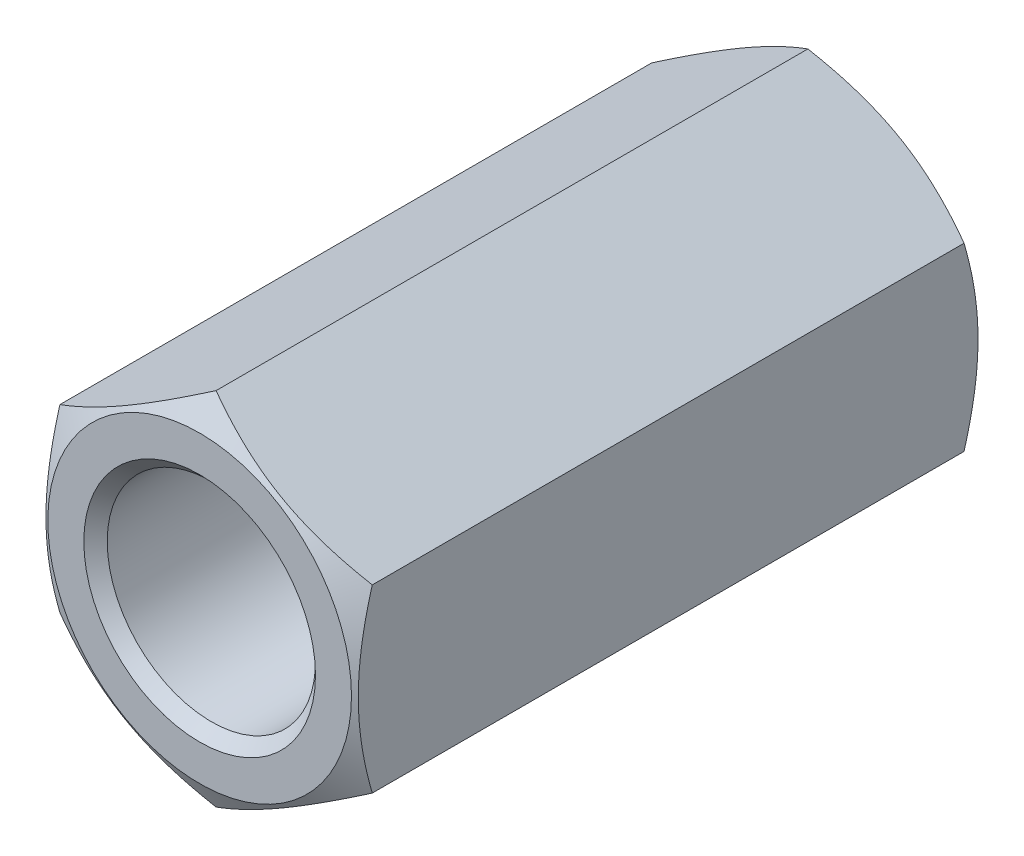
ISO-10303-21;
HEADER;
FILE_DESCRIPTION(('STEP AP214'),'2;1');
FILE_NAME('part.step','',(''),(''),'','','');
FILE_SCHEMA(('AUTOMOTIVE_DESIGN { 1 0 10303 214 1 1 1 1 }'));
ENDSEC;
DATA;
#1=APPLICATION_CONTEXT('core data for automotive mechanical design processes');
#2=APPLICATION_PROTOCOL_DEFINITION('international standard','automotive_design',2000,#1);
#3=PRODUCT_CONTEXT('',#1,'mechanical');
#4=PRODUCT('Part','Part','',(#3));
#5=PRODUCT_RELATED_PRODUCT_CATEGORY('part','',(#4));
#6=PRODUCT_DEFINITION_FORMATION('','',#4);
#7=PRODUCT_DEFINITION_CONTEXT('part definition',#1,'design');
#8=PRODUCT_DEFINITION('design','',#6,#7);
#9=PRODUCT_DEFINITION_SHAPE('','',#8);
#10=(LENGTH_UNIT() NAMED_UNIT(*) SI_UNIT(.MILLI.,.METRE.));
#11=(NAMED_UNIT(*) PLANE_ANGLE_UNIT() SI_UNIT($,.RADIAN.));
#12=(NAMED_UNIT(*) SI_UNIT($,.STERADIAN.) SOLID_ANGLE_UNIT());
#13=UNCERTAINTY_MEASURE_WITH_UNIT(LENGTH_MEASURE(1.E-05),#10,'distance_accuracy_value','');
#14=(GEOMETRIC_REPRESENTATION_CONTEXT(3) GLOBAL_UNCERTAINTY_ASSIGNED_CONTEXT((#13)) GLOBAL_UNIT_ASSIGNED_CONTEXT((#10,
#11,#12)) REPRESENTATION_CONTEXT('',''));
#15=CARTESIAN_POINT('',(0.,0.,0.));
#16=DIRECTION('',(0.,0.,1.));
#17=DIRECTION('',(1.,0.,0.));
#18=AXIS2_PLACEMENT_3D('',#15,#16,#17);
#19=CARTESIAN_POINT('',(0.,-20.7846096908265,72.));
#20=DIRECTION('',(-0.5,-0.86602540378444,0.));
#21=DIRECTION('',(0.86602540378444,-0.5,0.));
#22=AXIS2_PLACEMENT_3D('',#19,#20,#21);
#23=PLANE('',#22);
#24=DIRECTION('',(0.,0.,-1.));
#25=VECTOR('',#24,1.);
#26=CARTESIAN_POINT('',(-18.,-10.3923048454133,72.));
#27=LINE('',#26,#25);
#28=CARTESIAN_POINT('',(-18.,-10.3923048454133,70.1036297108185));
#29=VERTEX_POINT('',#28);
#30=CARTESIAN_POINT('',(-18.,-10.3923048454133,1.89637028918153));
#31=VERTEX_POINT('',#30);
#32=EDGE_CURVE('E87',#29,#31,#27,.T.);
#33=ORIENTED_EDGE('',*,*,#32,.T.);
#34=CARTESIAN_POINT('',(-18.0002,-10.3921893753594,1.89643695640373));
#35=CARTESIAN_POINT('',(-17.6045674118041,-10.6206079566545,1.76456850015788));
#36=CARTESIAN_POINT('',(-17.2073916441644,-10.8499174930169,1.63868402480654));
#37=CARTESIAN_POINT('',(-16.4098552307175,-11.310375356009,1.40054637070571));
#38=CARTESIAN_POINT('',(-16.0094935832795,-11.5415242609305,1.28829767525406));
#39=CARTESIAN_POINT('',(-15.2048116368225,-12.0061075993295,1.0789404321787));
#40=CARTESIAN_POINT('',(-14.8004842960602,-12.2395460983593,0.981867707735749));
#41=CARTESIAN_POINT('',(-13.9890201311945,-12.7080451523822,0.804946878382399));
#42=CARTESIAN_POINT('',(-13.5818834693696,-12.9431056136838,0.725097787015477));
#43=CARTESIAN_POINT('',(-12.7752328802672,-13.4088255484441,0.586020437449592));
#44=CARTESIAN_POINT('',(-12.3757788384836,-13.6394504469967,0.526331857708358));
#45=CARTESIAN_POINT('',(-11.5750403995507,-14.1017570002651,0.426247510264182));
#46=CARTESIAN_POINT('',(-11.1737559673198,-14.3334386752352,0.385852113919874));
#47=CARTESIAN_POINT('',(-10.3705130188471,-14.7971912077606,0.32537409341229));
#48=CARTESIAN_POINT('',(-9.96855587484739,-15.0292612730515,0.305267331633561));
#49=CARTESIAN_POINT('',(-9.16427056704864,-15.4936156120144,0.285798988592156));
#50=CARTESIAN_POINT('',(-8.76194241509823,-15.7258998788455,0.286436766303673));
#51=CARTESIAN_POINT('',(-8.0097806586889,-16.1601606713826,0.30700871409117));
#52=CARTESIAN_POINT('',(-7.65989346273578,-16.3621681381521,0.324434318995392));
#53=CARTESIAN_POINT('',(-6.96095368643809,-16.765701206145,0.374644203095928));
#54=CARTESIAN_POINT('',(-6.61190109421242,-16.9672268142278,0.407428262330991));
#55=CARTESIAN_POINT('',(-5.91476277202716,-17.3697198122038,0.487786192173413));
#56=CARTESIAN_POINT('',(-5.56667820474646,-17.5706865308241,0.535373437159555));
#57=CARTESIAN_POINT('',(-4.87216610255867,-17.9716632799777,0.644498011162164));
#58=CARTESIAN_POINT('',(-4.52573856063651,-18.1716733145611,0.706035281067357));
#59=CARTESIAN_POINT('',(-3.47411308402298,-18.7788295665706,0.913137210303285));
#60=CARTESIAN_POINT('',(-2.771960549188,-19.1842175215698,1.07935260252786));
#61=CARTESIAN_POINT('',(-1.37812528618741,-19.9889486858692,1.45659330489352));
#62=CARTESIAN_POINT('',(-0.68642471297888,-20.3883021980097,1.66753002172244));
#63=CARTESIAN_POINT('',(0.000199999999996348,-20.7847251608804,1.89643695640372));
#64=B_SPLINE_CURVE_WITH_KNOTS('',3,(#34,#35,#36,#37,#38,#39,#40,#41,#42,#43,#44,#45,#46,#47,#48,
#49,#50,#51,#52,#53,#54,#55,#56,#57,#58,#59,#60,#61,#62,#63),.UNSPECIFIED.,.F.,.F.,(4,2,2,2,2,2,
2,2,2,2,2,2,2,2,4),(0.,1.42650335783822,2.85347447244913,4.28376471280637,5.71397301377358,
7.10888071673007,8.5038152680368,9.89708828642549,11.2903182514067,12.5031974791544,
13.7160593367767,14.9300201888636,16.1439758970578,18.6253607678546,21.1018751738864),.UNSPECIFIED.);
#65=CARTESIAN_POINT('',(0.,-20.7846096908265,1.89637028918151));
#66=VERTEX_POINT('',#65);
#67=EDGE_CURVE('E29',#31,#66,#64,.T.);
#68=ORIENTED_EDGE('',*,*,#67,.T.);
#69=DIRECTION('',(0.,0.,-1.));
#70=VECTOR('',#69,1.);
#71=CARTESIAN_POINT('',(0.,-20.7846096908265,72.));
#72=LINE('',#71,#70);
#73=CARTESIAN_POINT('',(0.,-20.7846096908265,70.1036297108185));
#74=VERTEX_POINT('',#73);
#75=EDGE_CURVE('E100',#74,#66,#72,.T.);
#76=ORIENTED_EDGE('',*,*,#75,.F.);
#77=CARTESIAN_POINT('',(0.000199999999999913,-20.7847251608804,70.1035630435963));
#78=CARTESIAN_POINT('',(-0.395432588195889,-20.5563065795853,70.2354314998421));
#79=CARTESIAN_POINT('',(-0.792608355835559,-20.3269970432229,70.3613159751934));
#80=CARTESIAN_POINT('',(-1.59014476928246,-19.8665391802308,70.5994536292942));
#81=CARTESIAN_POINT('',(-1.99050641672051,-19.6353902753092,70.7117023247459));
#82=CARTESIAN_POINT('',(-2.79518836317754,-19.1708069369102,70.9210595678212));
#83=CARTESIAN_POINT('',(-3.19951570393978,-18.9373684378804,71.0181322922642));
#84=CARTESIAN_POINT('',(-4.01097986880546,-18.4688693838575,71.1950531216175));
#85=CARTESIAN_POINT('',(-4.41811653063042,-18.2338089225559,71.2749022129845));
#86=CARTESIAN_POINT('',(-5.22476711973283,-17.7680889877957,71.4139795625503));
#87=CARTESIAN_POINT('',(-5.62422116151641,-17.537464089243,71.4736681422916));
#88=CARTESIAN_POINT('',(-6.42495960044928,-17.0751575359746,71.5737524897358));
#89=CARTESIAN_POINT('',(-6.82624403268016,-16.8434758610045,71.6141478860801));
#90=CARTESIAN_POINT('',(-7.62948698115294,-16.3797233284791,71.6746259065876));
#91=CARTESIAN_POINT('',(-8.03144412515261,-16.1476532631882,71.6947326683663));
#92=CARTESIAN_POINT('',(-8.83572943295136,-15.6832989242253,71.7142010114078));
#93=CARTESIAN_POINT('',(-9.23805758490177,-15.4510146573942,71.7135632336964));
#94=CARTESIAN_POINT('',(-9.99021934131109,-15.0167538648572,71.6929912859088));
#95=CARTESIAN_POINT('',(-10.3401065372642,-14.8147463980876,71.6755656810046));
#96=CARTESIAN_POINT('',(-11.0390463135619,-14.4112133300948,71.625355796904));
#97=CARTESIAN_POINT('',(-11.3880989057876,-14.209687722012,71.5925717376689));
#98=CARTESIAN_POINT('',(-12.0852372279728,-13.8071947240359,71.5122138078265));
#99=CARTESIAN_POINT('',(-12.4333217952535,-13.6062280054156,71.4646265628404));
#100=CARTESIAN_POINT('',(-13.1278338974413,-13.2052512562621,71.3555019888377));
#101=CARTESIAN_POINT('',(-13.4742614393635,-13.0052412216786,71.2939647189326));
#102=CARTESIAN_POINT('',(-14.525886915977,-12.3980849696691,71.0868627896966));
#103=CARTESIAN_POINT('',(-15.228039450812,-11.99269701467,70.920647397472));
#104=CARTESIAN_POINT('',(-16.6218747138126,-11.1879658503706,70.5434066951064));
#105=CARTESIAN_POINT('',(-17.3135752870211,-10.78861233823,70.3324699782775));
#106=CARTESIAN_POINT('',(-18.0002,-10.3921893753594,70.1035630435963));
#107=B_SPLINE_CURVE_WITH_KNOTS('',3,(#77,#78,#79,#80,#81,#82,#83,#84,#85,#86,#87,#88,#89,#90,
#91,#92,#93,#94,#95,#96,#97,#98,#99,#100,#101,#102,#103,#104,#105,#106),.UNSPECIFIED.,.F.,.F.,
(4,2,2,2,2,2,2,2,2,2,2,2,2,2,4),(0.,1.4265033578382,2.85347447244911,4.28376471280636,
5.71397301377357,7.10888071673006,8.50381526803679,9.89708828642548,11.2903182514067,
12.5031974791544,13.7160593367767,14.9300201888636,16.1439758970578,18.6253607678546,
21.1018751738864),.UNSPECIFIED.);
#108=EDGE_CURVE('E91',#74,#29,#107,.T.);
#109=ORIENTED_EDGE('',*,*,#108,.T.);
#110=EDGE_LOOP('',(#33,#68,#76,#109));
#111=FACE_BOUND('',#110,.T.);
#112=ADVANCED_FACE('F14',(#111),#23,.T.);
#113=CARTESIAN_POINT('',(0.,-20.7846096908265,72.));
#114=DIRECTION('',(-0.5,0.86602540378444,0.));
#115=DIRECTION('',(-0.86602540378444,-0.5,0.));
#116=AXIS2_PLACEMENT_3D('',#113,#114,#115);
#117=PLANE('',#116);
#118=CARTESIAN_POINT('',(18.0002,-10.3921893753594,1.89643695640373));
#119=CARTESIAN_POINT('',(17.6045674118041,-10.6206079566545,1.76456850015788));
#120=CARTESIAN_POINT('',(17.2073916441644,-10.8499174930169,1.63868402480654));
#121=CARTESIAN_POINT('',(16.4098552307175,-11.310375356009,1.40054637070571));
#122=CARTESIAN_POINT('',(16.0094935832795,-11.5415242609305,1.28829767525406));
#123=CARTESIAN_POINT('',(15.2048116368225,-12.0061075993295,1.0789404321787));
#124=CARTESIAN_POINT('',(14.8004842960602,-12.2395460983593,0.981867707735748));
#125=CARTESIAN_POINT('',(13.9890201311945,-12.7080451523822,0.804946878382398));
#126=CARTESIAN_POINT('',(13.5818834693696,-12.9431056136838,0.725097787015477));
#127=CARTESIAN_POINT('',(12.7752328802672,-13.4088255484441,0.586020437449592));
#128=CARTESIAN_POINT('',(12.3757788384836,-13.6394504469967,0.526331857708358));
#129=CARTESIAN_POINT('',(11.5750403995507,-14.1017570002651,0.426247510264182));
#130=CARTESIAN_POINT('',(11.1737559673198,-14.3334386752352,0.385852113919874));
#131=CARTESIAN_POINT('',(10.3705130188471,-14.7971912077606,0.32537409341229));
#132=CARTESIAN_POINT('',(9.96855587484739,-15.0292612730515,0.305267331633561));
#133=CARTESIAN_POINT('',(9.16427056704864,-15.4936156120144,0.285798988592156));
#134=CARTESIAN_POINT('',(8.76194241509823,-15.7258998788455,0.286436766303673));
#135=CARTESIAN_POINT('',(8.0097806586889,-16.1601606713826,0.30700871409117));
#136=CARTESIAN_POINT('',(7.65989346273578,-16.3621681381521,0.324434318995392));
#137=CARTESIAN_POINT('',(6.96095368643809,-16.765701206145,0.374644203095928));
#138=CARTESIAN_POINT('',(6.61190109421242,-16.9672268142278,0.407428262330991));
#139=CARTESIAN_POINT('',(5.91476277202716,-17.3697198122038,0.487786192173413));
#140=CARTESIAN_POINT('',(5.56667820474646,-17.5706865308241,0.535373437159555));
#141=CARTESIAN_POINT('',(4.87216610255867,-17.9716632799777,0.644498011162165));
#142=CARTESIAN_POINT('',(4.52573856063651,-18.1716733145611,0.706035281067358));
#143=CARTESIAN_POINT('',(3.47411308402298,-18.7788295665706,0.913137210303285));
#144=CARTESIAN_POINT('',(2.771960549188,-19.1842175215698,1.07935260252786));
#145=CARTESIAN_POINT('',(1.37812528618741,-19.9889486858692,1.45659330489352));
#146=CARTESIAN_POINT('',(0.68642471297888,-20.3883021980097,1.66753002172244));
#147=CARTESIAN_POINT('',(-0.00019999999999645,-20.7847251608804,1.89643695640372));
#148=B_SPLINE_CURVE_WITH_KNOTS('',3,(#118,#119,#120,#121,#122,#123,#124,#125,#126,#127,#128,
#129,#130,#131,#132,#133,#134,#135,#136,#137,#138,#139,#140,#141,#142,#143,#144,#145,#146,#147),
.UNSPECIFIED.,.F.,.F.,(4,2,2,2,2,2,2,2,2,2,2,2,2,2,4),(0.,1.42650335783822,2.85347447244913,
4.28376471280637,5.71397301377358,7.10888071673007,8.5038152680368,9.89708828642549,
11.2903182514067,12.5031974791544,13.7160593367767,14.9300201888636,16.1439758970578,
18.6253607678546,21.1018751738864),.UNSPECIFIED.);
#149=CARTESIAN_POINT('',(18.,-10.3923048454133,1.89637028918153));
#150=VERTEX_POINT('',#149);
#151=EDGE_CURVE('E168',#150,#66,#148,.T.);
#152=ORIENTED_EDGE('',*,*,#151,.F.);
#153=DIRECTION('',(0.,0.,-1.));
#154=VECTOR('',#153,1.);
#155=CARTESIAN_POINT('',(18.,-10.3923048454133,72.));
#156=LINE('',#155,#154);
#157=CARTESIAN_POINT('',(18.,-10.3923048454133,70.1036297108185));
#158=VERTEX_POINT('',#157);
#159=EDGE_CURVE('E97',#158,#150,#156,.T.);
#160=ORIENTED_EDGE('',*,*,#159,.F.);
#161=CARTESIAN_POINT('',(-0.000200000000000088,-20.7847251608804,70.1035630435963));
#162=CARTESIAN_POINT('',(0.395432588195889,-20.5563065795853,70.2354314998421));
#163=CARTESIAN_POINT('',(0.792608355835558,-20.3269970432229,70.3613159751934));
#164=CARTESIAN_POINT('',(1.59014476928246,-19.8665391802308,70.5994536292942));
#165=CARTESIAN_POINT('',(1.99050641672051,-19.6353902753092,70.7117023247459));
#166=CARTESIAN_POINT('',(2.79518836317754,-19.1708069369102,70.9210595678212));
#167=CARTESIAN_POINT('',(3.19951570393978,-18.9373684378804,71.0181322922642));
#168=CARTESIAN_POINT('',(4.01097986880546,-18.4688693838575,71.1950531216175));
#169=CARTESIAN_POINT('',(4.41811653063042,-18.2338089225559,71.2749022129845));
#170=CARTESIAN_POINT('',(5.22476711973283,-17.7680889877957,71.4139795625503));
#171=CARTESIAN_POINT('',(5.62422116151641,-17.537464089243,71.4736681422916));
#172=CARTESIAN_POINT('',(6.42495960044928,-17.0751575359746,71.5737524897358));
#173=CARTESIAN_POINT('',(6.82624403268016,-16.8434758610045,71.6141478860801));
#174=CARTESIAN_POINT('',(7.62948698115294,-16.3797233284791,71.6746259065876));
#175=CARTESIAN_POINT('',(8.03144412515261,-16.1476532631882,71.6947326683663));
#176=CARTESIAN_POINT('',(8.83572943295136,-15.6832989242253,71.7142010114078));
#177=CARTESIAN_POINT('',(9.23805758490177,-15.4510146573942,71.7135632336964));
#178=CARTESIAN_POINT('',(9.99021934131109,-15.0167538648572,71.6929912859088));
#179=CARTESIAN_POINT('',(10.3401065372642,-14.8147463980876,71.6755656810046));
#180=CARTESIAN_POINT('',(11.0390463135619,-14.4112133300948,71.625355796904));
#181=CARTESIAN_POINT('',(11.3880989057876,-14.209687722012,71.5925717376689));
#182=CARTESIAN_POINT('',(12.0852372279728,-13.8071947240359,71.5122138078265));
#183=CARTESIAN_POINT('',(12.4333217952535,-13.6062280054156,71.4646265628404));
#184=CARTESIAN_POINT('',(13.1278338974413,-13.2052512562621,71.3555019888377));
#185=CARTESIAN_POINT('',(13.4742614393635,-13.0052412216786,71.2939647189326));
#186=CARTESIAN_POINT('',(14.525886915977,-12.3980849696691,71.0868627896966));
#187=CARTESIAN_POINT('',(15.228039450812,-11.99269701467,70.920647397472));
#188=CARTESIAN_POINT('',(16.6218747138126,-11.1879658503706,70.5434066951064));
#189=CARTESIAN_POINT('',(17.3135752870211,-10.78861233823,70.3324699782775));
#190=CARTESIAN_POINT('',(18.0002,-10.3921893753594,70.1035630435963));
#191=B_SPLINE_CURVE_WITH_KNOTS('',3,(#161,#162,#163,#164,#165,#166,#167,#168,#169,#170,#171,
#172,#173,#174,#175,#176,#177,#178,#179,#180,#181,#182,#183,#184,#185,#186,#187,#188,#189,#190),
.UNSPECIFIED.,.F.,.F.,(4,2,2,2,2,2,2,2,2,2,2,2,2,2,4),(0.,1.4265033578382,2.85347447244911,
4.28376471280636,5.71397301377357,7.10888071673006,8.50381526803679,9.89708828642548,
11.2903182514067,12.5031974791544,13.7160593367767,14.9300201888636,16.1439758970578,
18.6253607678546,21.1018751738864),.UNSPECIFIED.);
#192=EDGE_CURVE('E149',#74,#158,#191,.T.);
#193=ORIENTED_EDGE('',*,*,#192,.F.);
#194=ORIENTED_EDGE('',*,*,#75,.T.);
#195=EDGE_LOOP('',(#152,#160,#193,#194));
#196=FACE_BOUND('',#195,.T.);
#197=ADVANCED_FACE('F159',(#196),#117,.F.);
#198=CARTESIAN_POINT('',(18.,-10.3923048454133,72.));
#199=DIRECTION('',(-1.,0.,0.));
#200=DIRECTION('',(0.,0.,1.));
#201=AXIS2_PLACEMENT_3D('',#198,#199,#200);
#202=PLANE('',#201);
#203=CARTESIAN_POINT('',(18.,-27.9834060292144,9.10635912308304));
#204=CARTESIAN_POINT('',(18.,-27.590044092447,8.91535797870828));
#205=CARTESIAN_POINT('',(18.,-27.1962224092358,8.7253041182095));
#206=CARTESIAN_POINT('',(18.,-26.4075636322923,8.34730537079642));
#207=CARTESIAN_POINT('',(18.,-26.0127265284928,8.15936050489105));
#208=CARTESIAN_POINT('',(18.,-24.8264440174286,7.59896191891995));
#209=CARTESIAN_POINT('',(18.,-24.0333427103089,7.23000034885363));
#210=CARTESIAN_POINT('',(18.,-22.4375721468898,6.50163590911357));
#211=CARTESIAN_POINT('',(18.,-21.6348743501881,6.14229541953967));
#212=CARTESIAN_POINT('',(18.,-20.023119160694,5.43822280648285));
#213=CARTESIAN_POINT('',(18.,-19.2140620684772,5.09348999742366));
#214=CARTESIAN_POINT('',(18.,-17.56191812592,4.411606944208));
#215=CARTESIAN_POINT('',(18.,-16.718578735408,4.07506541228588));
#216=CARTESIAN_POINT('',(18.,-15.0220527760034,3.42728654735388));
#217=CARTESIAN_POINT('',(18.,-14.1688651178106,3.11605204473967));
#218=CARTESIAN_POINT('',(18.,-12.4528878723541,2.52701239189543));
#219=CARTESIAN_POINT('',(18.,-11.590121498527,2.24914015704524));
#220=CARTESIAN_POINT('',(18.,-9.85213116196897,1.73568038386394));
#221=CARTESIAN_POINT('',(18.,-8.97691119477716,1.50007959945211));
#222=CARTESIAN_POINT('',(18.,-7.65700800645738,1.18751888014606));
#223=CARTESIAN_POINT('',(18.,-7.2170816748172,1.09035053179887));
#224=CARTESIAN_POINT('',(18.,-6.33421030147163,0.910778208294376));
#225=CARTESIAN_POINT('',(18.,-5.89126532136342,0.828373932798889));
#226=CARTESIAN_POINT('',(18.,-5.00266552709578,0.6797815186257));
#227=CARTESIAN_POINT('',(18.,-4.55701080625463,0.613592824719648));
#228=CARTESIAN_POINT('',(18.,-3.6634326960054,0.498745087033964));
#229=CARTESIAN_POINT('',(18.,-3.21550930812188,0.450086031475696));
#230=CARTESIAN_POINT('',(18.,-2.32392383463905,0.371882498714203));
#231=CARTESIAN_POINT('',(18.,-1.88028319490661,0.342095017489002));
#232=CARTESIAN_POINT('',(18.,-0.992140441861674,0.301311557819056));
#233=CARTESIAN_POINT('',(18.,-0.547638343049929,0.290315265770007));
#234=CARTESIAN_POINT('',(18.,0.341433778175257,0.287375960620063));
#235=CARTESIAN_POINT('',(18.,0.786003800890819,0.295433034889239));
#236=CARTESIAN_POINT('',(18.,1.67440651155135,0.330403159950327));
#237=CARTESIAN_POINT('',(18.,2.11823916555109,0.35731705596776));
#238=CARTESIAN_POINT('',(18.,3.18282535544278,0.443916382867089));
#239=CARTESIAN_POINT('',(18.,3.80287329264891,0.512432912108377));
#240=CARTESIAN_POINT('',(18.,5.03841619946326,0.682553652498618));
#241=CARTESIAN_POINT('',(18.,5.65391054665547,0.784162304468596));
#242=CARTESIAN_POINT('',(18.,6.87974231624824,1.01685288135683));
#243=CARTESIAN_POINT('',(18.,7.49007537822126,1.14795755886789));
#244=CARTESIAN_POINT('',(18.,8.70464308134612,1.43563576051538));
#245=CARTESIAN_POINT('',(18.,9.30887781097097,1.59220891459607));
#246=CARTESIAN_POINT('',(18.,10.5246071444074,1.93073032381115));
#247=CARTESIAN_POINT('',(18.,11.1359655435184,2.11316434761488));
#248=CARTESIAN_POINT('',(18.,12.3526605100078,2.49701333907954));
#249=CARTESIAN_POINT('',(18.,12.9579970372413,2.69842843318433));
#250=CARTESIAN_POINT('',(18.,14.1629454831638,3.11702993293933));
#251=CARTESIAN_POINT('',(18.,14.7625591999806,3.33421118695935));
#252=CARTESIAN_POINT('',(18.,15.9568088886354,3.7817769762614));
#253=CARTESIAN_POINT('',(18.,16.5514449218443,4.01216134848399));
#254=CARTESIAN_POINT('',(18.,17.9667636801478,4.57570948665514));
#255=CARTESIAN_POINT('',(18.,18.7854042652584,4.91399458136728));
#256=CARTESIAN_POINT('',(18.,20.4156179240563,5.60723517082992));
#257=CARTESIAN_POINT('',(18.,21.2271905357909,5.96219174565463));
#258=CARTESIAN_POINT('',(18.,22.8446041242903,6.68539669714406));
#259=CARTESIAN_POINT('',(18.,23.6504437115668,7.05364817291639));
#260=CARTESIAN_POINT('',(18.,25.2571706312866,7.80072737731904));
#261=CARTESIAN_POINT('',(18.,26.0580580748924,8.17955486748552));
#262=CARTESIAN_POINT('',(18.,27.6566174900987,8.94622010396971));
#263=CARTESIAN_POINT('',(18.,28.4542847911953,9.33406757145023));
#264=CARTESIAN_POINT('',(18.,30.0461572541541,10.1168025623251));
#265=CARTESIAN_POINT('',(18.,30.8403624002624,10.5116901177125));
#266=CARTESIAN_POINT('',(18.,32.4257436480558,11.3072334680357));
#267=CARTESIAN_POINT('',(18.,33.2169201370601,11.7078884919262));
#268=CARTESIAN_POINT('',(18.,34.7967864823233,12.514062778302));
#269=CARTESIAN_POINT('',(18.,35.5854763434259,12.9195820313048));
#270=CARTESIAN_POINT('',(18.,37.8138986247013,14.0726749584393));
#271=CARTESIAN_POINT('',(18.,39.2511537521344,14.8250359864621));
#272=CARTESIAN_POINT('',(18.,42.1203421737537,16.3399420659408));
#273=CARTESIAN_POINT('',(18.,43.5522752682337,17.1024874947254));
#274=CARTESIAN_POINT('',(18.,46.4083062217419,18.6333974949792));
#275=CARTESIAN_POINT('',(18.,47.8324147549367,19.4017421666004));
#276=CARTESIAN_POINT('',(18.,49.9660736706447,20.5587752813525));
#277=CARTESIAN_POINT('',(18.,50.6768562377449,20.9451948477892));
#278=CARTESIAN_POINT('',(18.,52.0976821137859,21.7193882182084));
#279=CARTESIAN_POINT('',(18.,52.8077254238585,22.1071620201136));
#280=CARTESIAN_POINT('',(18.,53.5174412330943,22.4955344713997));
#281=B_SPLINE_CURVE_WITH_KNOTS('',3,(#203,#204,#205,#206,#207,#208,#209,#210,#211,#212,#213,
#214,#215,#216,#217,#218,#219,#220,#221,#222,#223,#224,#225,#226,#227,#228,#229,#230,#231,#232,
#233,#234,#235,#236,#237,#238,#239,#240,#241,#242,#243,#244,#245,#246,#247,#248,#249,#250,#251,
#252,#253,#254,#255,#256,#257,#258,#259,#260,#261,#262,#263,#264,#265,#266,#267,#268,#269,#270,
#271,#272,#273,#274,#275,#276,#277,#278,#279,#280),.UNSPECIFIED.,.F.,.F.,(4,2,2,2,2,2,2,2,2,2,2,
2,2,2,2,2,2,2,2,2,2,2,2,2,2,2,2,2,2,2,2,2,2,2,2,2,2,2,4),(0.,1.31184193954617,2.62369693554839,
5.24779162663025,7.88605724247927,10.5241989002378,13.2479177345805,15.9719407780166,
18.6903912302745,21.4079883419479,22.7593692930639,24.1107227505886,25.4620299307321,
26.8133362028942,28.1468681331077,29.480377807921,30.813893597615,32.1474691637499,
34.0179019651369,35.888585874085,37.7607177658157,39.6328224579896,41.5464479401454,
43.4600861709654,45.3731019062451,47.2860940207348,49.943186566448,52.6004514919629,
55.2583398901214,57.9161684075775,60.5770078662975,63.2378594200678,65.8983584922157,
68.5588523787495,73.425590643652,78.2925097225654,83.1469667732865,85.5740601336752,
88.0011497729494),.UNSPECIFIED.);
#282=CARTESIAN_POINT('',(18.,10.3923048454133,1.89637028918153));
#283=VERTEX_POINT('',#282);
#284=EDGE_CURVE('E175',#283,#150,#281,.F.);
#285=ORIENTED_EDGE('',*,*,#284,.F.);
#286=DIRECTION('',(0.,0.,-1.));
#287=VECTOR('',#286,1.);
#288=CARTESIAN_POINT('',(18.,10.3923048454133,72.));
#289=LINE('',#288,#287);
#290=CARTESIAN_POINT('',(18.,10.3923048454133,70.1036297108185));
#291=VERTEX_POINT('',#290);
#292=EDGE_CURVE('E89',#291,#283,#289,.T.);
#293=ORIENTED_EDGE('',*,*,#292,.F.);
#294=CARTESIAN_POINT('',(18.,-27.9834060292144,62.893640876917));
#295=CARTESIAN_POINT('',(18.,-27.590044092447,63.0846420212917));
#296=CARTESIAN_POINT('',(18.,-27.1962224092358,63.2746958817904));
#297=CARTESIAN_POINT('',(18.,-26.4075636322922,63.6526946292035));
#298=CARTESIAN_POINT('',(18.,-26.0127265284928,63.8406394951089));
#299=CARTESIAN_POINT('',(18.,-24.8264440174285,64.40103808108));
#300=CARTESIAN_POINT('',(18.,-24.0333427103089,64.7699996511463));
#301=CARTESIAN_POINT('',(18.,-22.4375721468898,65.4983640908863));
#302=CARTESIAN_POINT('',(18.,-21.6348743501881,65.8577045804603));
#303=CARTESIAN_POINT('',(18.,-20.023119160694,66.5617771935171));
#304=CARTESIAN_POINT('',(18.,-19.2140620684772,66.9065100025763));
#305=CARTESIAN_POINT('',(18.,-17.5619181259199,67.5883930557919));
#306=CARTESIAN_POINT('',(18.,-16.718578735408,67.924934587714));
#307=CARTESIAN_POINT('',(18.,-15.0220527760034,68.572713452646));
#308=CARTESIAN_POINT('',(18.,-14.1688651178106,68.8839479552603));
#309=CARTESIAN_POINT('',(18.,-12.4528878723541,69.4729876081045));
#310=CARTESIAN_POINT('',(18.,-11.590121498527,69.7508598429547));
#311=CARTESIAN_POINT('',(18.,-9.85213116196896,70.264319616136));
#312=CARTESIAN_POINT('',(18.,-8.97691119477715,70.4999204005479));
#313=CARTESIAN_POINT('',(18.,-7.65700800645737,70.8124811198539));
#314=CARTESIAN_POINT('',(18.,-7.21708167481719,70.9096494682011));
#315=CARTESIAN_POINT('',(18.,-6.33421030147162,71.0892217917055));
#316=CARTESIAN_POINT('',(18.,-5.89126532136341,71.171626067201));
#317=CARTESIAN_POINT('',(18.,-5.00266552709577,71.3202184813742));
#318=CARTESIAN_POINT('',(18.,-4.55701080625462,71.3864071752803));
#319=CARTESIAN_POINT('',(18.,-3.66343269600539,71.5012549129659));
#320=CARTESIAN_POINT('',(18.,-3.21550930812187,71.5499139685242));
#321=CARTESIAN_POINT('',(18.,-2.32392383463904,71.6281175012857));
#322=CARTESIAN_POINT('',(18.,-1.88028319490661,71.6579049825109));
#323=CARTESIAN_POINT('',(18.,-0.99214044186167,71.6986884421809));
#324=CARTESIAN_POINT('',(18.,-0.547638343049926,71.7096847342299));
#325=CARTESIAN_POINT('',(18.,0.341433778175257,71.7126240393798));
#326=CARTESIAN_POINT('',(18.,0.786003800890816,71.7045669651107));
#327=CARTESIAN_POINT('',(18.,1.67440651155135,71.6695968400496));
#328=CARTESIAN_POINT('',(18.,2.11823916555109,71.6426829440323));
#329=CARTESIAN_POINT('',(18.,3.18282535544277,71.5560836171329));
#330=CARTESIAN_POINT('',(18.,3.80287329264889,71.4875670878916));
#331=CARTESIAN_POINT('',(18.,5.03841619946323,71.3174463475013));
#332=CARTESIAN_POINT('',(18.,5.65391054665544,71.2158376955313));
#333=CARTESIAN_POINT('',(18.,6.87974231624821,70.9831471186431));
#334=CARTESIAN_POINT('',(18.,7.49007537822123,70.852042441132));
#335=CARTESIAN_POINT('',(18.,8.70464308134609,70.5643642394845));
#336=CARTESIAN_POINT('',(18.,9.30887781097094,70.4077910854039));
#337=CARTESIAN_POINT('',(18.,10.5246071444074,70.0692696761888));
#338=CARTESIAN_POINT('',(18.,11.1359655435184,69.8868356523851));
#339=CARTESIAN_POINT('',(18.,12.3526605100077,69.5029866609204));
#340=CARTESIAN_POINT('',(18.,12.9579970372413,69.3015715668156));
#341=CARTESIAN_POINT('',(18.,14.1629454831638,68.8829700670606));
#342=CARTESIAN_POINT('',(18.,14.7625591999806,68.6657888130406));
#343=CARTESIAN_POINT('',(18.,15.9568088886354,68.2182230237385));
#344=CARTESIAN_POINT('',(18.,16.5514449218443,67.987838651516));
#345=CARTESIAN_POINT('',(18.,17.9667636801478,67.4242905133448));
#346=CARTESIAN_POINT('',(18.,18.7854042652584,67.0860054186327));
#347=CARTESIAN_POINT('',(18.,20.4156179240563,66.39276482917));
#348=CARTESIAN_POINT('',(18.,21.2271905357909,66.0378082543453));
#349=CARTESIAN_POINT('',(18.,22.8446041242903,65.3146033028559));
#350=CARTESIAN_POINT('',(18.,23.6504437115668,64.9463518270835));
#351=CARTESIAN_POINT('',(18.,25.2571706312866,64.1992726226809));
#352=CARTESIAN_POINT('',(18.,26.0580580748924,63.8204451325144));
#353=CARTESIAN_POINT('',(18.,27.6566174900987,63.0537798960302));
#354=CARTESIAN_POINT('',(18.,28.4542847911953,62.6659324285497));
#355=CARTESIAN_POINT('',(18.,30.0461572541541,61.8831974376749));
#356=CARTESIAN_POINT('',(18.,30.8403624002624,61.4883098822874));
#357=CARTESIAN_POINT('',(18.,32.4257436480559,60.6927665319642));
#358=CARTESIAN_POINT('',(18.,33.2169201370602,60.2921115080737));
#359=CARTESIAN_POINT('',(18.,34.7967864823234,59.4859372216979));
#360=CARTESIAN_POINT('',(18.,35.585476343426,59.0804179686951));
#361=CARTESIAN_POINT('',(18.,37.8138986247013,57.9273250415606));
#362=CARTESIAN_POINT('',(18.,39.2511537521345,57.1749640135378));
#363=CARTESIAN_POINT('',(18.,42.1203421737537,55.6600579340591));
#364=CARTESIAN_POINT('',(18.,43.5522752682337,54.8975125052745));
#365=CARTESIAN_POINT('',(18.,46.4083062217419,53.3666025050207));
#366=CARTESIAN_POINT('',(18.,47.8324147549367,52.5982578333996));
#367=CARTESIAN_POINT('',(18.,49.9660736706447,51.4412247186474));
#368=CARTESIAN_POINT('',(18.,50.6768562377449,51.0548051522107));
#369=CARTESIAN_POINT('',(18.,52.097682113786,50.2806117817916));
#370=CARTESIAN_POINT('',(18.,52.8077254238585,49.8928379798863));
#371=CARTESIAN_POINT('',(18.,53.5174412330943,49.5044655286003));
#372=B_SPLINE_CURVE_WITH_KNOTS('',3,(#294,#295,#296,#297,#298,#299,#300,#301,#302,#303,#304,
#305,#306,#307,#308,#309,#310,#311,#312,#313,#314,#315,#316,#317,#318,#319,#320,#321,#322,#323,
#324,#325,#326,#327,#328,#329,#330,#331,#332,#333,#334,#335,#336,#337,#338,#339,#340,#341,#342,
#343,#344,#345,#346,#347,#348,#349,#350,#351,#352,#353,#354,#355,#356,#357,#358,#359,#360,#361,
#362,#363,#364,#365,#366,#367,#368,#369,#370,#371),.UNSPECIFIED.,.F.,.F.,(4,2,2,2,2,2,2,2,2,2,2,
2,2,2,2,2,2,2,2,2,2,2,2,2,2,2,2,2,2,2,2,2,2,2,2,2,2,2,4),(0.,1.31184193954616,2.62369693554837,
5.24779162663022,7.88605724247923,10.5241989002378,13.2479177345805,15.9719407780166,
18.6903912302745,21.4079883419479,22.7593692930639,24.1107227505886,25.4620299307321,
26.8133362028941,28.1468681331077,29.4803778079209,30.8138935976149,32.1474691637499,
34.0179019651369,35.8885858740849,37.7607177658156,39.6328224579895,41.5464479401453,
43.4600861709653,45.373101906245,47.2860940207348,49.943186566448,52.6004514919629,
55.2583398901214,57.9161684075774,60.5770078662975,63.2378594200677,65.8983584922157,
68.5588523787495,73.425590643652,78.2925097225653,83.1469667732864,85.5740601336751,
88.0011497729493),.UNSPECIFIED.);
#373=EDGE_CURVE('E142',#158,#291,#372,.T.);
#374=ORIENTED_EDGE('',*,*,#373,.F.);
#375=ORIENTED_EDGE('',*,*,#159,.T.);
#376=EDGE_LOOP('',(#285,#293,#374,#375));
#377=FACE_BOUND('',#376,.T.);
#378=ADVANCED_FACE('F162',(#377),#202,.F.);
#379=CARTESIAN_POINT('',(18.,10.3923048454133,72.));
#380=DIRECTION('',(-0.5,-0.86602540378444,0.));
#381=DIRECTION('',(0.86602540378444,-0.5,0.));
#382=AXIS2_PLACEMENT_3D('',#379,#380,#381);
#383=PLANE('',#382);
#384=CARTESIAN_POINT('',(-0.000199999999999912,20.7847251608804,1.89643695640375));
#385=CARTESIAN_POINT('',(0.395432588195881,20.5563065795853,1.7645685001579));
#386=CARTESIAN_POINT('',(0.792608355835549,20.3269970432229,1.63868402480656));
#387=CARTESIAN_POINT('',(1.59014476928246,19.8665391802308,1.40054637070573));
#388=CARTESIAN_POINT('',(1.9905064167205,19.6353902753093,1.28829767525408));
#389=CARTESIAN_POINT('',(2.79518836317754,19.1708069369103,1.07894043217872));
#390=CARTESIAN_POINT('',(3.19951570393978,18.9373684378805,0.981867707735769));
#391=CARTESIAN_POINT('',(4.01097986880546,18.4688693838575,0.804946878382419));
#392=CARTESIAN_POINT('',(4.41811653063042,18.2338089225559,0.725097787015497));
#393=CARTESIAN_POINT('',(5.22476711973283,17.7680889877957,0.586020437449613));
#394=CARTESIAN_POINT('',(5.62422116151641,17.5374640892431,0.52633185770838));
#395=CARTESIAN_POINT('',(6.42495960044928,17.0751575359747,0.426247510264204));
#396=CARTESIAN_POINT('',(6.82624403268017,16.8434758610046,0.385852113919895));
#397=CARTESIAN_POINT('',(7.62948698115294,16.3797233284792,0.325374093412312));
#398=CARTESIAN_POINT('',(8.03144412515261,16.1476532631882,0.305267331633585));
#399=CARTESIAN_POINT('',(8.83572943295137,15.6832989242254,0.285798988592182));
#400=CARTESIAN_POINT('',(9.2380575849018,15.4510146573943,0.2864367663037));
#401=CARTESIAN_POINT('',(9.99021934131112,15.0167538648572,0.307008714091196));
#402=CARTESIAN_POINT('',(10.3401065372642,14.8147463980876,0.324434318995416));
#403=CARTESIAN_POINT('',(11.0390463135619,14.4112133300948,0.374644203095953));
#404=CARTESIAN_POINT('',(11.3880989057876,14.209687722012,0.407428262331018));
#405=CARTESIAN_POINT('',(12.0852372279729,13.8071947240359,0.48778619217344));
#406=CARTESIAN_POINT('',(12.4333217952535,13.6062280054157,0.53537343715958));
#407=CARTESIAN_POINT('',(13.1278338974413,13.2052512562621,0.644498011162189));
#408=CARTESIAN_POINT('',(13.4742614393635,13.0052412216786,0.706035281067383));
#409=CARTESIAN_POINT('',(14.525886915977,12.3980849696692,0.913137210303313));
#410=CARTESIAN_POINT('',(15.228039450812,11.99269701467,1.07935260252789));
#411=CARTESIAN_POINT('',(16.6218747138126,11.1879658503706,1.45659330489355));
#412=CARTESIAN_POINT('',(17.3135752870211,10.7886123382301,1.66753002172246));
#413=CARTESIAN_POINT('',(18.0002,10.3921893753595,1.89643695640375));
#414=B_SPLINE_CURVE_WITH_KNOTS('',3,(#384,#385,#386,#387,#388,#389,#390,#391,#392,#393,#394,
#395,#396,#397,#398,#399,#400,#401,#402,#403,#404,#405,#406,#407,#408,#409,#410,#411,#412,#413),
.UNSPECIFIED.,.F.,.F.,(4,2,2,2,2,2,2,2,2,2,2,2,2,2,4),(0.,1.42650335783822,2.85347447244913,
4.28376471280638,5.71397301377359,7.10888071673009,8.50381526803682,9.89708828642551,
11.2903182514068,12.5031974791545,13.7160593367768,14.9300201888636,16.1439758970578,
18.6253607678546,21.1018751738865),.UNSPECIFIED.);
#415=CARTESIAN_POINT('',(0.,20.7846096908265,1.89637028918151));
#416=VERTEX_POINT('',#415);
#417=EDGE_CURVE('E83',#416,#283,#414,.T.);
#418=ORIENTED_EDGE('',*,*,#417,.F.);
#419=DIRECTION('',(0.,0.,-1.));
#420=VECTOR('',#419,1.);
#421=CARTESIAN_POINT('',(0.,20.7846096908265,72.));
#422=LINE('',#421,#420);
#423=CARTESIAN_POINT('',(0.,20.7846096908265,70.1036297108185));
#424=VERTEX_POINT('',#423);
#425=EDGE_CURVE('E82',#424,#416,#422,.T.);
#426=ORIENTED_EDGE('',*,*,#425,.F.);
#427=CARTESIAN_POINT('',(18.0002,10.3921893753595,70.1035630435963));
#428=CARTESIAN_POINT('',(17.6045674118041,10.6206079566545,70.2354314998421));
#429=CARTESIAN_POINT('',(17.2073916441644,10.8499174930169,70.3613159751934));
#430=CARTESIAN_POINT('',(16.4098552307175,11.310375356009,70.5994536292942));
#431=CARTESIAN_POINT('',(16.0094935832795,11.5415242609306,70.7117023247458));
#432=CARTESIAN_POINT('',(15.2048116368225,12.0061075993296,70.9210595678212));
#433=CARTESIAN_POINT('',(14.8004842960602,12.2395460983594,71.0181322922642));
#434=CARTESIAN_POINT('',(13.9890201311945,12.7080451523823,71.1950531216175));
#435=CARTESIAN_POINT('',(13.5818834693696,12.9431056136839,71.2749022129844));
#436=CARTESIAN_POINT('',(12.7752328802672,13.4088255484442,71.4139795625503));
#437=CARTESIAN_POINT('',(12.3757788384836,13.6394504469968,71.4736681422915));
#438=CARTESIAN_POINT('',(11.5750403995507,14.1017570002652,71.5737524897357));
#439=CARTESIAN_POINT('',(11.1737559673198,14.3334386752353,71.61414788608));
#440=CARTESIAN_POINT('',(10.370513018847,14.7971912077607,71.6746259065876));
#441=CARTESIAN_POINT('',(9.96855587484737,15.0292612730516,71.6947326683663));
#442=CARTESIAN_POINT('',(9.16427056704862,15.4936156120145,71.7142010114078));
#443=CARTESIAN_POINT('',(8.7619424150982,15.7258998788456,71.7135632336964));
#444=CARTESIAN_POINT('',(8.00978065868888,16.1601606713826,71.6929912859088));
#445=CARTESIAN_POINT('',(7.65989346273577,16.3621681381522,71.6755656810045));
#446=CARTESIAN_POINT('',(6.96095368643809,16.765701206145,71.6253557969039));
#447=CARTESIAN_POINT('',(6.61190109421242,16.9672268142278,71.5925717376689));
#448=CARTESIAN_POINT('',(5.91476277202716,17.3697198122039,71.5122138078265));
#449=CARTESIAN_POINT('',(5.56667820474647,17.5706865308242,71.4646265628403));
#450=CARTESIAN_POINT('',(4.87216610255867,17.9716632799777,71.3555019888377));
#451=CARTESIAN_POINT('',(4.52573856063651,18.1716733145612,71.2939647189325));
#452=CARTESIAN_POINT('',(3.47411308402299,18.7788295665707,71.0868627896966));
#453=CARTESIAN_POINT('',(2.77196054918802,19.1842175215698,70.920647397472));
#454=CARTESIAN_POINT('',(1.37812528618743,19.9889486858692,70.5434066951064));
#455=CARTESIAN_POINT('',(0.686424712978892,20.3883021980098,70.3324699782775));
#456=CARTESIAN_POINT('',(-0.000199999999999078,20.7847251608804,70.1035630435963));
#457=B_SPLINE_CURVE_WITH_KNOTS('',3,(#427,#428,#429,#430,#431,#432,#433,#434,#435,#436,#437,
#438,#439,#440,#441,#442,#443,#444,#445,#446,#447,#448,#449,#450,#451,#452,#453,#454,#455,#456),
.UNSPECIFIED.,.F.,.F.,(4,2,2,2,2,2,2,2,2,2,2,2,2,2,4),(0.,1.42650335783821,2.85347447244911,
4.28376471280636,5.71397301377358,7.10888071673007,8.5038152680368,9.89708828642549,
11.2903182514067,12.5031974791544,13.7160593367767,14.9300201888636,16.1439758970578,
18.6253607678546,21.1018751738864),.UNSPECIFIED.);
#458=EDGE_CURVE('E135',#291,#424,#457,.T.);
#459=ORIENTED_EDGE('',*,*,#458,.F.);
#460=ORIENTED_EDGE('',*,*,#292,.T.);
#461=EDGE_LOOP('',(#418,#426,#459,#460));
#462=FACE_BOUND('',#461,.T.);
#463=ADVANCED_FACE('F221',(#462),#383,.F.);
#464=CARTESIAN_POINT('',(0.,20.7846096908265,72.));
#465=DIRECTION('',(0.5,-0.86602540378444,0.));
#466=DIRECTION('',(0.86602540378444,0.5,0.));
#467=AXIS2_PLACEMENT_3D('',#464,#465,#466);
#468=PLANE('',#467);
#469=CARTESIAN_POINT('',(-18.0002,10.3921893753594,1.89643695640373));
#470=CARTESIAN_POINT('',(-17.6045674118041,10.6206079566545,1.76456850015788));
#471=CARTESIAN_POINT('',(-17.2073916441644,10.8499174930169,1.63868402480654));
#472=CARTESIAN_POINT('',(-16.4098552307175,11.310375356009,1.40054637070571));
#473=CARTESIAN_POINT('',(-16.0094935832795,11.5415242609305,1.28829767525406));
#474=CARTESIAN_POINT('',(-15.2048116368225,12.0061075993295,1.0789404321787));
#475=CARTESIAN_POINT('',(-14.8004842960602,12.2395460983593,0.981867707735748));
#476=CARTESIAN_POINT('',(-13.9890201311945,12.7080451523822,0.804946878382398));
#477=CARTESIAN_POINT('',(-13.5818834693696,12.9431056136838,0.725097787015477));
#478=CARTESIAN_POINT('',(-12.7752328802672,13.4088255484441,0.586020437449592));
#479=CARTESIAN_POINT('',(-12.3757788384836,13.6394504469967,0.526331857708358));
#480=CARTESIAN_POINT('',(-11.5750403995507,14.1017570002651,0.426247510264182));
#481=CARTESIAN_POINT('',(-11.1737559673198,14.3334386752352,0.385852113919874));
#482=CARTESIAN_POINT('',(-10.3705130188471,14.7971912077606,0.32537409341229));
#483=CARTESIAN_POINT('',(-9.96855587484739,15.0292612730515,0.305267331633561));
#484=CARTESIAN_POINT('',(-9.16427056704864,15.4936156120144,0.285798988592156));
#485=CARTESIAN_POINT('',(-8.76194241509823,15.7258998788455,0.286436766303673));
#486=CARTESIAN_POINT('',(-8.0097806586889,16.1601606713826,0.30700871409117));
#487=CARTESIAN_POINT('',(-7.65989346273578,16.3621681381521,0.324434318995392));
#488=CARTESIAN_POINT('',(-6.96095368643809,16.765701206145,0.374644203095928));
#489=CARTESIAN_POINT('',(-6.61190109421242,16.9672268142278,0.407428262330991));
#490=CARTESIAN_POINT('',(-5.91476277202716,17.3697198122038,0.487786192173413));
#491=CARTESIAN_POINT('',(-5.56667820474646,17.5706865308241,0.535373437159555));
#492=CARTESIAN_POINT('',(-4.87216610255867,17.9716632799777,0.644498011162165));
#493=CARTESIAN_POINT('',(-4.52573856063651,18.1716733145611,0.706035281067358));
#494=CARTESIAN_POINT('',(-3.47411308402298,18.7788295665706,0.913137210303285));
#495=CARTESIAN_POINT('',(-2.771960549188,19.1842175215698,1.07935260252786));
#496=CARTESIAN_POINT('',(-1.37812528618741,19.9889486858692,1.45659330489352));
#497=CARTESIAN_POINT('',(-0.68642471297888,20.3883021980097,1.66753002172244));
#498=CARTESIAN_POINT('',(0.00019999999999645,20.7847251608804,1.89643695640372));
#499=B_SPLINE_CURVE_WITH_KNOTS('',3,(#469,#470,#471,#472,#473,#474,#475,#476,#477,#478,#479,
#480,#481,#482,#483,#484,#485,#486,#487,#488,#489,#490,#491,#492,#493,#494,#495,#496,#497,#498),
.UNSPECIFIED.,.F.,.F.,(4,2,2,2,2,2,2,2,2,2,2,2,2,2,4),(0.,1.42650335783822,2.85347447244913,
4.28376471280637,5.71397301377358,7.10888071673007,8.5038152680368,9.89708828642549,
11.2903182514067,12.5031974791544,13.7160593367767,14.9300201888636,16.1439758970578,
18.6253607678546,21.1018751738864),.UNSPECIFIED.);
#500=CARTESIAN_POINT('',(-18.,10.3923048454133,1.89637028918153));
#501=VERTEX_POINT('',#500);
#502=EDGE_CURVE('E68',#501,#416,#499,.T.);
#503=ORIENTED_EDGE('',*,*,#502,.F.);
#504=DIRECTION('',(0.,0.,-1.));
#505=VECTOR('',#504,1.);
#506=CARTESIAN_POINT('',(-18.,10.3923048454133,72.));
#507=LINE('',#506,#505);
#508=CARTESIAN_POINT('',(-18.,10.3923048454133,70.1036297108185));
#509=VERTEX_POINT('',#508);
#510=EDGE_CURVE('E80',#509,#501,#507,.T.);
#511=ORIENTED_EDGE('',*,*,#510,.F.);
#512=CARTESIAN_POINT('',(0.000200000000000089,20.7847251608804,70.1035630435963));
#513=CARTESIAN_POINT('',(-0.395432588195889,20.5563065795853,70.2354314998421));
#514=CARTESIAN_POINT('',(-0.792608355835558,20.3269970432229,70.3613159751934));
#515=CARTESIAN_POINT('',(-1.59014476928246,19.8665391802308,70.5994536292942));
#516=CARTESIAN_POINT('',(-1.99050641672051,19.6353902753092,70.7117023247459));
#517=CARTESIAN_POINT('',(-2.79518836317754,19.1708069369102,70.9210595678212));
#518=CARTESIAN_POINT('',(-3.19951570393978,18.9373684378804,71.0181322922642));
#519=CARTESIAN_POINT('',(-4.01097986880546,18.4688693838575,71.1950531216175));
#520=CARTESIAN_POINT('',(-4.41811653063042,18.2338089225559,71.2749022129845));
#521=CARTESIAN_POINT('',(-5.22476711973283,17.7680889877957,71.4139795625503));
#522=CARTESIAN_POINT('',(-5.62422116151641,17.537464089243,71.4736681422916));
#523=CARTESIAN_POINT('',(-6.42495960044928,17.0751575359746,71.5737524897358));
#524=CARTESIAN_POINT('',(-6.82624403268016,16.8434758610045,71.6141478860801));
#525=CARTESIAN_POINT('',(-7.62948698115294,16.3797233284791,71.6746259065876));
#526=CARTESIAN_POINT('',(-8.03144412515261,16.1476532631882,71.6947326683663));
#527=CARTESIAN_POINT('',(-8.83572943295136,15.6832989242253,71.7142010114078));
#528=CARTESIAN_POINT('',(-9.23805758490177,15.4510146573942,71.7135632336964));
#529=CARTESIAN_POINT('',(-9.99021934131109,15.0167538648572,71.6929912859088));
#530=CARTESIAN_POINT('',(-10.3401065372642,14.8147463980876,71.6755656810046));
#531=CARTESIAN_POINT('',(-11.0390463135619,14.4112133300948,71.625355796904));
#532=CARTESIAN_POINT('',(-11.3880989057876,14.209687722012,71.5925717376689));
#533=CARTESIAN_POINT('',(-12.0852372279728,13.8071947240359,71.5122138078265));
#534=CARTESIAN_POINT('',(-12.4333217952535,13.6062280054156,71.4646265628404));
#535=CARTESIAN_POINT('',(-13.1278338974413,13.2052512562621,71.3555019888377));
#536=CARTESIAN_POINT('',(-13.4742614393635,13.0052412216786,71.2939647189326));
#537=CARTESIAN_POINT('',(-14.525886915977,12.3980849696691,71.0868627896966));
#538=CARTESIAN_POINT('',(-15.228039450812,11.99269701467,70.920647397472));
#539=CARTESIAN_POINT('',(-16.6218747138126,11.1879658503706,70.5434066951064));
#540=CARTESIAN_POINT('',(-17.3135752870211,10.78861233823,70.3324699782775));
#541=CARTESIAN_POINT('',(-18.0002,10.3921893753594,70.1035630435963));
#542=B_SPLINE_CURVE_WITH_KNOTS('',3,(#512,#513,#514,#515,#516,#517,#518,#519,#520,#521,#522,
#523,#524,#525,#526,#527,#528,#529,#530,#531,#532,#533,#534,#535,#536,#537,#538,#539,#540,#541),
.UNSPECIFIED.,.F.,.F.,(4,2,2,2,2,2,2,2,2,2,2,2,2,2,4),(0.,1.4265033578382,2.85347447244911,
4.28376471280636,5.71397301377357,7.10888071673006,8.50381526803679,9.89708828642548,
11.2903182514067,12.5031974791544,13.7160593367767,14.9300201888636,16.1439758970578,
18.6253607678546,21.1018751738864),.UNSPECIFIED.);
#543=EDGE_CURVE('E37',#424,#509,#542,.T.);
#544=ORIENTED_EDGE('',*,*,#543,.F.);
#545=ORIENTED_EDGE('',*,*,#425,.T.);
#546=EDGE_LOOP('',(#503,#511,#544,#545));
#547=FACE_BOUND('',#546,.T.);
#548=ADVANCED_FACE('F79',(#547),#468,.F.);
#549=CARTESIAN_POINT('',(-18.,-10.3923048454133,72.));
#550=DIRECTION('',(-1.,0.,0.));
#551=DIRECTION('',(0.,0.,1.));
#552=AXIS2_PLACEMENT_3D('',#549,#550,#551);
#553=PLANE('',#552);
#554=ORIENTED_EDGE('',*,*,#510,.T.);
#555=CARTESIAN_POINT('',(-18.,-27.9834060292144,9.10635912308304));
#556=CARTESIAN_POINT('',(-18.,-27.590044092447,8.91535797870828));
#557=CARTESIAN_POINT('',(-18.,-27.1962224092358,8.7253041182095));
#558=CARTESIAN_POINT('',(-18.,-26.4075636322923,8.34730537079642));
#559=CARTESIAN_POINT('',(-18.,-26.0127265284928,8.15936050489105));
#560=CARTESIAN_POINT('',(-18.,-24.8264440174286,7.59896191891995));
#561=CARTESIAN_POINT('',(-18.,-24.0333427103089,7.23000034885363));
#562=CARTESIAN_POINT('',(-18.,-22.4375721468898,6.50163590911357));
#563=CARTESIAN_POINT('',(-18.,-21.6348743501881,6.14229541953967));
#564=CARTESIAN_POINT('',(-18.,-20.023119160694,5.43822280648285));
#565=CARTESIAN_POINT('',(-18.,-19.2140620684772,5.09348999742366));
#566=CARTESIAN_POINT('',(-18.,-17.56191812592,4.411606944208));
#567=CARTESIAN_POINT('',(-18.,-16.718578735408,4.07506541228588));
#568=CARTESIAN_POINT('',(-18.,-15.0220527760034,3.42728654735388));
#569=CARTESIAN_POINT('',(-18.,-14.1688651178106,3.11605204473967));
#570=CARTESIAN_POINT('',(-18.,-12.4528878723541,2.52701239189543));
#571=CARTESIAN_POINT('',(-18.,-11.590121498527,2.24914015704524));
#572=CARTESIAN_POINT('',(-18.,-9.85213116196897,1.73568038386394));
#573=CARTESIAN_POINT('',(-18.,-8.97691119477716,1.50007959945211));
#574=CARTESIAN_POINT('',(-18.,-7.65700800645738,1.18751888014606));
#575=CARTESIAN_POINT('',(-18.,-7.2170816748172,1.09035053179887));
#576=CARTESIAN_POINT('',(-18.,-6.33421030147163,0.910778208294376));
#577=CARTESIAN_POINT('',(-18.,-5.89126532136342,0.828373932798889));
#578=CARTESIAN_POINT('',(-18.,-5.00266552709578,0.6797815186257));
#579=CARTESIAN_POINT('',(-18.,-4.55701080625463,0.613592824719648));
#580=CARTESIAN_POINT('',(-18.,-3.6634326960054,0.498745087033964));
#581=CARTESIAN_POINT('',(-18.,-3.21550930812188,0.450086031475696));
#582=CARTESIAN_POINT('',(-18.,-2.32392383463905,0.371882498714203));
#583=CARTESIAN_POINT('',(-18.,-1.88028319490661,0.342095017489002));
#584=CARTESIAN_POINT('',(-18.,-0.992140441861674,0.301311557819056));
#585=CARTESIAN_POINT('',(-18.,-0.547638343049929,0.290315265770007));
#586=CARTESIAN_POINT('',(-18.,0.341433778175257,0.287375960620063));
#587=CARTESIAN_POINT('',(-18.,0.786003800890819,0.295433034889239));
#588=CARTESIAN_POINT('',(-18.,1.67440651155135,0.330403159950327));
#589=CARTESIAN_POINT('',(-18.,2.11823916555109,0.35731705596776));
#590=CARTESIAN_POINT('',(-18.,3.18282535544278,0.443916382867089));
#591=CARTESIAN_POINT('',(-18.,3.80287329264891,0.512432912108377));
#592=CARTESIAN_POINT('',(-18.,5.03841619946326,0.682553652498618));
#593=CARTESIAN_POINT('',(-18.,5.65391054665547,0.784162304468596));
#594=CARTESIAN_POINT('',(-18.,6.87974231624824,1.01685288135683));
#595=CARTESIAN_POINT('',(-18.,7.49007537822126,1.14795755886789));
#596=CARTESIAN_POINT('',(-18.,8.70464308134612,1.43563576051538));
#597=CARTESIAN_POINT('',(-18.,9.30887781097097,1.59220891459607));
#598=CARTESIAN_POINT('',(-18.,10.5246071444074,1.93073032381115));
#599=CARTESIAN_POINT('',(-18.,11.1359655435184,2.11316434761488));
#600=CARTESIAN_POINT('',(-18.,12.3526605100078,2.49701333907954));
#601=CARTESIAN_POINT('',(-18.,12.9579970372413,2.69842843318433));
#602=CARTESIAN_POINT('',(-18.,14.1629454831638,3.11702993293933));
#603=CARTESIAN_POINT('',(-18.,14.7625591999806,3.33421118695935));
#604=CARTESIAN_POINT('',(-18.,15.9568088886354,3.7817769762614));
#605=CARTESIAN_POINT('',(-18.,16.5514449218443,4.01216134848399));
#606=CARTESIAN_POINT('',(-18.,17.9667636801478,4.57570948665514));
#607=CARTESIAN_POINT('',(-18.,18.7854042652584,4.91399458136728));
#608=CARTESIAN_POINT('',(-18.,20.4156179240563,5.60723517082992));
#609=CARTESIAN_POINT('',(-18.,21.2271905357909,5.96219174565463));
#610=CARTESIAN_POINT('',(-18.,22.8446041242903,6.68539669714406));
#611=CARTESIAN_POINT('',(-18.,23.6504437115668,7.05364817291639));
#612=CARTESIAN_POINT('',(-18.,25.2571706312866,7.80072737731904));
#613=CARTESIAN_POINT('',(-18.,26.0580580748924,8.17955486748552));
#614=CARTESIAN_POINT('',(-18.,27.6566174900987,8.94622010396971));
#615=CARTESIAN_POINT('',(-18.,28.4542847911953,9.33406757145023));
#616=CARTESIAN_POINT('',(-18.,30.0461572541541,10.1168025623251));
#617=CARTESIAN_POINT('',(-18.,30.8403624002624,10.5116901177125));
#618=CARTESIAN_POINT('',(-18.,32.4257436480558,11.3072334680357));
#619=CARTESIAN_POINT('',(-18.,33.2169201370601,11.7078884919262));
#620=CARTESIAN_POINT('',(-18.,34.7967864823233,12.514062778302));
#621=CARTESIAN_POINT('',(-18.,35.5854763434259,12.9195820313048));
#622=CARTESIAN_POINT('',(-18.,37.8138986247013,14.0726749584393));
#623=CARTESIAN_POINT('',(-18.,39.2511537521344,14.8250359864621));
#624=CARTESIAN_POINT('',(-18.,42.1203421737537,16.3399420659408));
#625=CARTESIAN_POINT('',(-18.,43.5522752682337,17.1024874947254));
#626=CARTESIAN_POINT('',(-18.,46.4083062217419,18.6333974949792));
#627=CARTESIAN_POINT('',(-18.,47.8324147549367,19.4017421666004));
#628=CARTESIAN_POINT('',(-18.,49.9660736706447,20.5587752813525));
#629=CARTESIAN_POINT('',(-18.,50.6768562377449,20.9451948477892));
#630=CARTESIAN_POINT('',(-18.,52.0976821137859,21.7193882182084));
#631=CARTESIAN_POINT('',(-18.,52.8077254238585,22.1071620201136));
#632=CARTESIAN_POINT('',(-18.,53.5174412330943,22.4955344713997));
#633=B_SPLINE_CURVE_WITH_KNOTS('',3,(#555,#556,#557,#558,#559,#560,#561,#562,#563,#564,#565,
#566,#567,#568,#569,#570,#571,#572,#573,#574,#575,#576,#577,#578,#579,#580,#581,#582,#583,#584,
#585,#586,#587,#588,#589,#590,#591,#592,#593,#594,#595,#596,#597,#598,#599,#600,#601,#602,#603,
#604,#605,#606,#607,#608,#609,#610,#611,#612,#613,#614,#615,#616,#617,#618,#619,#620,#621,#622,
#623,#624,#625,#626,#627,#628,#629,#630,#631,#632),.UNSPECIFIED.,.F.,.F.,(4,2,2,2,2,2,2,2,2,2,2,
2,2,2,2,2,2,2,2,2,2,2,2,2,2,2,2,2,2,2,2,2,2,2,2,2,2,2,4),(0.,1.31184193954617,2.62369693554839,
5.24779162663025,7.88605724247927,10.5241989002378,13.2479177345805,15.9719407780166,
18.6903912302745,21.4079883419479,22.7593692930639,24.1107227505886,25.4620299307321,
26.8133362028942,28.1468681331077,29.480377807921,30.813893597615,32.1474691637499,
34.0179019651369,35.888585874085,37.7607177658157,39.6328224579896,41.5464479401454,
43.4600861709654,45.3731019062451,47.2860940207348,49.943186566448,52.6004514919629,
55.2583398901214,57.9161684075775,60.5770078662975,63.2378594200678,65.8983584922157,
68.5588523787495,73.425590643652,78.2925097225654,83.1469667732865,85.5740601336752,
88.0011497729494),.UNSPECIFIED.);
#634=EDGE_CURVE('E64',#501,#31,#633,.F.);
#635=ORIENTED_EDGE('',*,*,#634,.T.);
#636=ORIENTED_EDGE('',*,*,#32,.F.);
#637=CARTESIAN_POINT('',(-18.,-27.9834060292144,62.893640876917));
#638=CARTESIAN_POINT('',(-18.,-27.590044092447,63.0846420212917));
#639=CARTESIAN_POINT('',(-18.,-27.1962224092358,63.2746958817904));
#640=CARTESIAN_POINT('',(-18.,-26.4075636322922,63.6526946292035));
#641=CARTESIAN_POINT('',(-18.,-26.0127265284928,63.8406394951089));
#642=CARTESIAN_POINT('',(-18.,-24.8264440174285,64.40103808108));
#643=CARTESIAN_POINT('',(-18.,-24.0333427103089,64.7699996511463));
#644=CARTESIAN_POINT('',(-18.,-22.4375721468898,65.4983640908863));
#645=CARTESIAN_POINT('',(-18.,-21.6348743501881,65.8577045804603));
#646=CARTESIAN_POINT('',(-18.,-20.023119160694,66.5617771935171));
#647=CARTESIAN_POINT('',(-18.,-19.2140620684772,66.9065100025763));
#648=CARTESIAN_POINT('',(-18.,-17.5619181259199,67.5883930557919));
#649=CARTESIAN_POINT('',(-18.,-16.718578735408,67.924934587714));
#650=CARTESIAN_POINT('',(-18.,-15.0220527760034,68.572713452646));
#651=CARTESIAN_POINT('',(-18.,-14.1688651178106,68.8839479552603));
#652=CARTESIAN_POINT('',(-18.,-12.4528878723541,69.4729876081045));
#653=CARTESIAN_POINT('',(-18.,-11.590121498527,69.7508598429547));
#654=CARTESIAN_POINT('',(-18.,-9.85213116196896,70.264319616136));
#655=CARTESIAN_POINT('',(-18.,-8.97691119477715,70.4999204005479));
#656=CARTESIAN_POINT('',(-18.,-7.65700800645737,70.8124811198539));
#657=CARTESIAN_POINT('',(-18.,-7.21708167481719,70.9096494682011));
#658=CARTESIAN_POINT('',(-18.,-6.33421030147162,71.0892217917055));
#659=CARTESIAN_POINT('',(-18.,-5.89126532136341,71.171626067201));
#660=CARTESIAN_POINT('',(-18.,-5.00266552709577,71.3202184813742));
#661=CARTESIAN_POINT('',(-18.,-4.55701080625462,71.3864071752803));
#662=CARTESIAN_POINT('',(-18.,-3.66343269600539,71.5012549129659));
#663=CARTESIAN_POINT('',(-18.,-3.21550930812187,71.5499139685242));
#664=CARTESIAN_POINT('',(-18.,-2.32392383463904,71.6281175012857));
#665=CARTESIAN_POINT('',(-18.,-1.88028319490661,71.6579049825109));
#666=CARTESIAN_POINT('',(-18.,-0.99214044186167,71.6986884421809));
#667=CARTESIAN_POINT('',(-18.,-0.547638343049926,71.7096847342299));
#668=CARTESIAN_POINT('',(-18.,0.341433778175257,71.7126240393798));
#669=CARTESIAN_POINT('',(-18.,0.786003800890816,71.7045669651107));
#670=CARTESIAN_POINT('',(-18.,1.67440651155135,71.6695968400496));
#671=CARTESIAN_POINT('',(-18.,2.11823916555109,71.6426829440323));
#672=CARTESIAN_POINT('',(-18.,3.18282535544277,71.5560836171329));
#673=CARTESIAN_POINT('',(-18.,3.80287329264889,71.4875670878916));
#674=CARTESIAN_POINT('',(-18.,5.03841619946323,71.3174463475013));
#675=CARTESIAN_POINT('',(-18.,5.65391054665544,71.2158376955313));
#676=CARTESIAN_POINT('',(-18.,6.87974231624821,70.9831471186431));
#677=CARTESIAN_POINT('',(-18.,7.49007537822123,70.852042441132));
#678=CARTESIAN_POINT('',(-18.,8.70464308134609,70.5643642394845));
#679=CARTESIAN_POINT('',(-18.,9.30887781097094,70.4077910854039));
#680=CARTESIAN_POINT('',(-18.,10.5246071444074,70.0692696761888));
#681=CARTESIAN_POINT('',(-18.,11.1359655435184,69.8868356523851));
#682=CARTESIAN_POINT('',(-18.,12.3526605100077,69.5029866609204));
#683=CARTESIAN_POINT('',(-18.,12.9579970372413,69.3015715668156));
#684=CARTESIAN_POINT('',(-18.,14.1629454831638,68.8829700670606));
#685=CARTESIAN_POINT('',(-18.,14.7625591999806,68.6657888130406));
#686=CARTESIAN_POINT('',(-18.,15.9568088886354,68.2182230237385));
#687=CARTESIAN_POINT('',(-18.,16.5514449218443,67.987838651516));
#688=CARTESIAN_POINT('',(-18.,17.9667636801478,67.4242905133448));
#689=CARTESIAN_POINT('',(-18.,18.7854042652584,67.0860054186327));
#690=CARTESIAN_POINT('',(-18.,20.4156179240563,66.39276482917));
#691=CARTESIAN_POINT('',(-18.,21.2271905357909,66.0378082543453));
#692=CARTESIAN_POINT('',(-18.,22.8446041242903,65.3146033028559));
#693=CARTESIAN_POINT('',(-18.,23.6504437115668,64.9463518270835));
#694=CARTESIAN_POINT('',(-18.,25.2571706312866,64.1992726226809));
#695=CARTESIAN_POINT('',(-18.,26.0580580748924,63.8204451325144));
#696=CARTESIAN_POINT('',(-18.,27.6566174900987,63.0537798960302));
#697=CARTESIAN_POINT('',(-18.,28.4542847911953,62.6659324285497));
#698=CARTESIAN_POINT('',(-18.,30.0461572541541,61.8831974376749));
#699=CARTESIAN_POINT('',(-18.,30.8403624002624,61.4883098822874));
#700=CARTESIAN_POINT('',(-18.,32.4257436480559,60.6927665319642));
#701=CARTESIAN_POINT('',(-18.,33.2169201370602,60.2921115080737));
#702=CARTESIAN_POINT('',(-18.,34.7967864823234,59.4859372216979));
#703=CARTESIAN_POINT('',(-18.,35.585476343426,59.0804179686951));
#704=CARTESIAN_POINT('',(-18.,37.8138986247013,57.9273250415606));
#705=CARTESIAN_POINT('',(-18.,39.2511537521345,57.1749640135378));
#706=CARTESIAN_POINT('',(-18.,42.1203421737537,55.6600579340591));
#707=CARTESIAN_POINT('',(-18.,43.5522752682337,54.8975125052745));
#708=CARTESIAN_POINT('',(-18.,46.4083062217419,53.3666025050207));
#709=CARTESIAN_POINT('',(-18.,47.8324147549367,52.5982578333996));
#710=CARTESIAN_POINT('',(-18.,49.9660736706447,51.4412247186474));
#711=CARTESIAN_POINT('',(-18.,50.6768562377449,51.0548051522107));
#712=CARTESIAN_POINT('',(-18.,52.097682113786,50.2806117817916));
#713=CARTESIAN_POINT('',(-18.,52.8077254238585,49.8928379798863));
#714=CARTESIAN_POINT('',(-18.,53.5174412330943,49.5044655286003));
#715=B_SPLINE_CURVE_WITH_KNOTS('',3,(#637,#638,#639,#640,#641,#642,#643,#644,#645,#646,#647,
#648,#649,#650,#651,#652,#653,#654,#655,#656,#657,#658,#659,#660,#661,#662,#663,#664,#665,#666,
#667,#668,#669,#670,#671,#672,#673,#674,#675,#676,#677,#678,#679,#680,#681,#682,#683,#684,#685,
#686,#687,#688,#689,#690,#691,#692,#693,#694,#695,#696,#697,#698,#699,#700,#701,#702,#703,#704,
#705,#706,#707,#708,#709,#710,#711,#712,#713,#714),.UNSPECIFIED.,.F.,.F.,(4,2,2,2,2,2,2,2,2,2,2,
2,2,2,2,2,2,2,2,2,2,2,2,2,2,2,2,2,2,2,2,2,2,2,2,2,2,2,4),(0.,1.31184193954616,2.62369693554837,
5.24779162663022,7.88605724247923,10.5241989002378,13.2479177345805,15.9719407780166,
18.6903912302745,21.4079883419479,22.7593692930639,24.1107227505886,25.4620299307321,
26.8133362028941,28.1468681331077,29.4803778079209,30.8138935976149,32.1474691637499,
34.0179019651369,35.8885858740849,37.7607177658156,39.6328224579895,41.5464479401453,
43.4600861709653,45.373101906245,47.2860940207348,49.943186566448,52.6004514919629,
55.2583398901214,57.9161684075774,60.5770078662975,63.2378594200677,65.8983584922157,
68.5588523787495,73.425590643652,78.2925097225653,83.1469667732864,85.5740601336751,
88.0011497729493),.UNSPECIFIED.);
#716=EDGE_CURVE('E86',#29,#509,#715,.T.);
#717=ORIENTED_EDGE('',*,*,#716,.T.);
#718=EDGE_LOOP('',(#554,#635,#636,#717));
#719=FACE_BOUND('',#718,.T.);
#720=ADVANCED_FACE('F85',(#719),#553,.T.);
#721=CARTESIAN_POINT('',(-18.,-10.3923048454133,0.));
#722=DIRECTION('',(0.,0.,-1.));
#723=DIRECTION('',(-1.,0.,0.));
#724=AXIS2_PLACEMENT_3D('',#721,#722,#723);
#725=PLANE('',#724);
#726=CARTESIAN_POINT('',(0.,0.,0.));
#727=DIRECTION('',(0.,0.,-1.));
#728=DIRECTION('',(-1.,0.,0.));
#729=AXIS2_PLACEMENT_3D('',#726,#727,#728);
#730=CIRCLE('',#729,13.35);
#731=CARTESIAN_POINT('',(-13.35,0.,0.));
#732=VERTEX_POINT('',#731);
#733=EDGE_CURVE('E110',#732,#732,#730,.F.);
#734=ORIENTED_EDGE('',*,*,#733,.T.);
#735=EDGE_LOOP('',(#734));
#736=FACE_BOUND('',#735,.T.);
#737=CARTESIAN_POINT('',(0.,0.,0.));
#738=DIRECTION('',(0.,0.,1.));
#739=DIRECTION('',(1.,0.,0.));
#740=AXIS2_PLACEMENT_3D('',#737,#738,#739);
#741=CIRCLE('',#740,17.5);
#742=CARTESIAN_POINT('',(17.5,0.,0.));
#743=VERTEX_POINT('',#742);
#744=EDGE_CURVE('E74',#743,#743,#741,.T.);
#745=ORIENTED_EDGE('',*,*,#744,.F.);
#746=EDGE_LOOP('',(#745));
#747=FACE_BOUND('',#746,.T.);
#748=ADVANCED_FACE('F193',(#736,#747),#725,.T.);
#749=CARTESIAN_POINT('',(-18.,-10.3923048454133,72.));
#750=DIRECTION('',(0.,0.,-1.));
#751=DIRECTION('',(-1.,0.,0.));
#752=AXIS2_PLACEMENT_3D('',#749,#750,#751);
#753=PLANE('',#752);
#754=CARTESIAN_POINT('',(0.,0.,72.));
#755=DIRECTION('',(0.,0.,-1.));
#756=DIRECTION('',(-1.,0.,0.));
#757=AXIS2_PLACEMENT_3D('',#754,#755,#756);
#758=CIRCLE('',#757,13.35);
#759=CARTESIAN_POINT('',(-13.35,0.,72.));
#760=VERTEX_POINT('',#759);
#761=EDGE_CURVE('E9',#760,#760,#758,.T.);
#762=ORIENTED_EDGE('',*,*,#761,.T.);
#763=EDGE_LOOP('',(#762));
#764=FACE_BOUND('',#763,.T.);
#765=CARTESIAN_POINT('',(0.,0.,72.));
#766=DIRECTION('',(0.,0.,1.));
#767=DIRECTION('',(1.,0.,0.));
#768=AXIS2_PLACEMENT_3D('',#765,#766,#767);
#769=CIRCLE('',#768,17.5);
#770=CARTESIAN_POINT('',(17.5,0.,72.));
#771=VERTEX_POINT('',#770);
#772=EDGE_CURVE('E185',#771,#771,#769,.T.);
#773=ORIENTED_EDGE('',*,*,#772,.T.);
#774=EDGE_LOOP('',(#773));
#775=FACE_BOUND('',#774,.T.);
#776=ADVANCED_FACE('F190',(#764,#775),#753,.F.);
#777=CARTESIAN_POINT('',(0.,0.,72.));
#778=DIRECTION('',(0.,0.,-1.));
#779=DIRECTION('',(-1.,0.,0.));
#780=AXIS2_PLACEMENT_3D('',#777,#778,#779);
#781=CYLINDRICAL_SURFACE('',#780,12.);
#782=CARTESIAN_POINT('',(0.,0.,1.35000000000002));
#783=DIRECTION('',(0.,0.,-1.));
#784=DIRECTION('',(-1.,0.,0.));
#785=AXIS2_PLACEMENT_3D('',#782,#783,#784);
#786=CIRCLE('',#785,12.);
#787=CARTESIAN_POINT('',(-12.,0.,1.35000000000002));
#788=VERTEX_POINT('',#787);
#789=EDGE_CURVE('E22',#788,#788,#786,.T.);
#790=ORIENTED_EDGE('',*,*,#789,.T.);
#791=EDGE_LOOP('',(#790));
#792=FACE_BOUND('',#791,.T.);
#793=CARTESIAN_POINT('',(0.,0.,70.65));
#794=DIRECTION('',(0.,0.,-1.));
#795=DIRECTION('',(-1.,0.,0.));
#796=AXIS2_PLACEMENT_3D('',#793,#794,#795);
#797=CIRCLE('',#796,12.);
#798=CARTESIAN_POINT('',(-12.,0.,70.65));
#799=VERTEX_POINT('',#798);
#800=EDGE_CURVE('E335',#799,#799,#797,.F.);
#801=ORIENTED_EDGE('',*,*,#800,.T.);
#802=EDGE_LOOP('',(#801));
#803=FACE_BOUND('',#802,.T.);
#804=ADVANCED_FACE('F120',(#792,#803),#781,.F.);
#805=CARTESIAN_POINT('',(0.,0.,72.));
#806=DIRECTION('',(0.,0.,-1.));
#807=DIRECTION('',(-1.,0.,0.));
#808=AXIS2_PLACEMENT_3D('',#805,#806,#807);
#809=CONICAL_SURFACE('',#808,17.5,1.0471975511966);
#810=ORIENTED_EDGE('',*,*,#192,.T.);
#811=ORIENTED_EDGE('',*,*,#373,.T.);
#812=ORIENTED_EDGE('',*,*,#458,.T.);
#813=ORIENTED_EDGE('',*,*,#543,.T.);
#814=ORIENTED_EDGE('',*,*,#716,.F.);
#815=ORIENTED_EDGE('',*,*,#108,.F.);
#816=EDGE_LOOP('',(#810,#811,#812,#813,#814,#815));
#817=FACE_BOUND('',#816,.T.);
#818=ORIENTED_EDGE('',*,*,#772,.F.);
#819=EDGE_LOOP('',(#818));
#820=FACE_BOUND('',#819,.T.);
#821=ADVANCED_FACE('F115',(#817,#820),#809,.T.);
#822=CARTESIAN_POINT('',(0.,0.,5.20785094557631));
#823=DIRECTION('',(0.,0.,1.));
#824=DIRECTION('',(1.,0.,0.));
#825=AXIS2_PLACEMENT_3D('',#822,#823,#824);
#826=CONICAL_SURFACE('',#825,26.5202624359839,1.0471975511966);
#827=ORIENTED_EDGE('',*,*,#634,.F.);
#828=ORIENTED_EDGE('',*,*,#502,.T.);
#829=ORIENTED_EDGE('',*,*,#417,.T.);
#830=ORIENTED_EDGE('',*,*,#284,.T.);
#831=ORIENTED_EDGE('',*,*,#151,.T.);
#832=ORIENTED_EDGE('',*,*,#67,.F.);
#833=EDGE_LOOP('',(#827,#828,#829,#830,#831,#832));
#834=FACE_BOUND('',#833,.T.);
#835=ORIENTED_EDGE('',*,*,#744,.T.);
#836=EDGE_LOOP('',(#835));
#837=FACE_BOUND('',#836,.T.);
#838=ADVANCED_FACE('F66',(#834,#837),#826,.T.);
#839=CARTESIAN_POINT('',(0.,0.,0.));
#840=DIRECTION('',(0.,0.,-1.));
#841=DIRECTION('',(-1.,0.,0.));
#842=AXIS2_PLACEMENT_3D('',#839,#840,#841);
#843=CONICAL_SURFACE('',#842,13.35,0.785398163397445);
#844=ORIENTED_EDGE('',*,*,#789,.F.);
#845=EDGE_LOOP('',(#844));
#846=FACE_BOUND('',#845,.T.);
#847=ORIENTED_EDGE('',*,*,#733,.F.);
#848=EDGE_LOOP('',(#847));
#849=FACE_BOUND('',#848,.T.);
#850=ADVANCED_FACE('F165',(#846,#849),#843,.F.);
#851=CARTESIAN_POINT('',(0.,0.,70.65));
#852=DIRECTION('',(0.,0.,1.));
#853=DIRECTION('',(1.,0.,0.));
#854=AXIS2_PLACEMENT_3D('',#851,#852,#853);
#855=CONICAL_SURFACE('',#854,12.,0.785398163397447);
#856=ORIENTED_EDGE('',*,*,#761,.F.);
#857=EDGE_LOOP('',(#856));
#858=FACE_BOUND('',#857,.T.);
#859=ORIENTED_EDGE('',*,*,#800,.F.);
#860=EDGE_LOOP('',(#859));
#861=FACE_BOUND('',#860,.T.);
#862=ADVANCED_FACE('F16',(#858,#861),#855,.F.);
#863=CLOSED_SHELL('',(#112,#197,#378,#463,#548,#720,#748,#776,#804,#821,#838,#850,#862));
#864=MANIFOLD_SOLID_BREP('B1',#863);
#865=ADVANCED_BREP_SHAPE_REPRESENTATION('',(#18,#864),#14);
#866=SHAPE_DEFINITION_REPRESENTATION(#9,#865);
ENDSEC;
END-ISO-10303-21;
